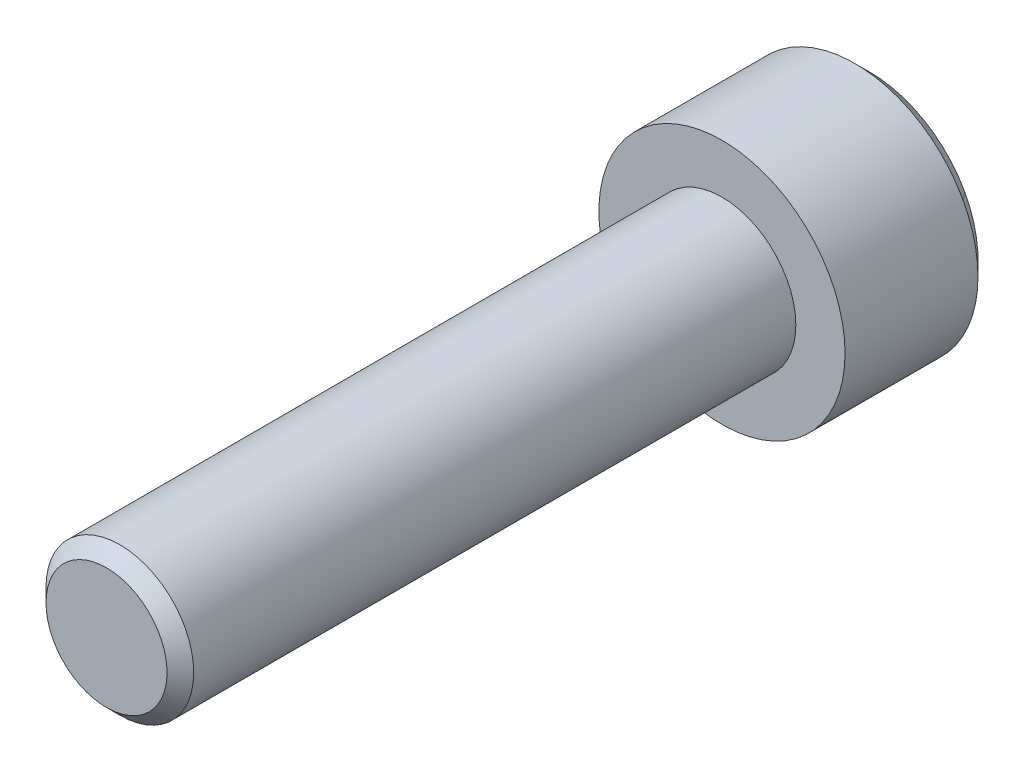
ISO-10303-21;
HEADER;
FILE_DESCRIPTION(('STEP AP214'),'2;1');
FILE_NAME('part.step','',(''),(''),'','','');
FILE_SCHEMA(('AUTOMOTIVE_DESIGN { 1 0 10303 214 1 1 1 1 }'));
ENDSEC;
DATA;
#1=APPLICATION_CONTEXT('core data for automotive mechanical design processes');
#2=APPLICATION_PROTOCOL_DEFINITION('international standard','automotive_design',2000,#1);
#3=PRODUCT_CONTEXT('',#1,'mechanical');
#4=PRODUCT('Part','Part','',(#3));
#5=PRODUCT_RELATED_PRODUCT_CATEGORY('part','',(#4));
#6=PRODUCT_DEFINITION_FORMATION('','',#4);
#7=PRODUCT_DEFINITION_CONTEXT('part definition',#1,'design');
#8=PRODUCT_DEFINITION('design','',#6,#7);
#9=PRODUCT_DEFINITION_SHAPE('','',#8);
#10=(LENGTH_UNIT() NAMED_UNIT(*) SI_UNIT(.MILLI.,.METRE.));
#11=(NAMED_UNIT(*) PLANE_ANGLE_UNIT() SI_UNIT($,.RADIAN.));
#12=(NAMED_UNIT(*) SI_UNIT($,.STERADIAN.) SOLID_ANGLE_UNIT());
#13=UNCERTAINTY_MEASURE_WITH_UNIT(LENGTH_MEASURE(1.E-05),#10,'distance_accuracy_value','');
#14=(GEOMETRIC_REPRESENTATION_CONTEXT(3) GLOBAL_UNCERTAINTY_ASSIGNED_CONTEXT((#13)) GLOBAL_UNIT_ASSIGNED_CONTEXT((#10,
#11,#12)) REPRESENTATION_CONTEXT('',''));
#15=CARTESIAN_POINT('',(0.,0.,0.));
#16=DIRECTION('',(0.,0.,1.));
#17=DIRECTION('',(1.,0.,0.));
#18=AXIS2_PLACEMENT_3D('',#15,#16,#17);
#19=CARTESIAN_POINT('',(0.,0.,2.99999999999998));
#20=DIRECTION('',(0.,0.,-1.));
#21=DIRECTION('',(-1.,0.,0.));
#22=AXIS2_PLACEMENT_3D('',#19,#20,#21);
#23=PLANE('',#22);
#24=DIRECTION('',(0.500000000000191,-0.86602540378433,0.));
#25=VECTOR('',#24,1.);
#26=CARTESIAN_POINT('',(1.44337567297,2.5,2.99999999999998));
#27=LINE('',#26,#25);
#28=CARTESIAN_POINT('',(2.88675134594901,-5.62050406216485E-13,2.99999999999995));
#29=VERTEX_POINT('',#28);
#30=CARTESIAN_POINT('',(1.44337567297,2.5,2.99999999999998));
#31=VERTEX_POINT('',#30);
#32=EDGE_CURVE('E88',#29,#31,#27,.F.);
#33=ORIENTED_EDGE('',*,*,#32,.F.);
#34=DIRECTION('',(-0.500000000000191,-0.86602540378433,0.));
#35=VECTOR('',#34,1.);
#36=CARTESIAN_POINT('',(2.88675134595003,0.,2.99999999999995));
#37=LINE('',#36,#35);
#38=CARTESIAN_POINT('',(1.44337567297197,-2.50000000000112,2.99999999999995));
#39=VERTEX_POINT('',#38);
#40=EDGE_CURVE('E96',#39,#29,#37,.F.);
#41=ORIENTED_EDGE('',*,*,#40,.F.);
#42=DIRECTION('',(-1.,0.,0.));
#43=VECTOR('',#42,1.);
#44=CARTESIAN_POINT('',(1.44337567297,-2.49999999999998,2.99999999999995));
#45=LINE('',#44,#43);
#46=CARTESIAN_POINT('',(-1.44337567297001,-2.5,2.99999999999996));
#47=VERTEX_POINT('',#46);
#48=EDGE_CURVE('E95',#47,#39,#45,.F.);
#49=ORIENTED_EDGE('',*,*,#48,.F.);
#50=DIRECTION('',(-0.500000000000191,0.86602540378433,0.));
#51=VECTOR('',#50,1.);
#52=CARTESIAN_POINT('',(-1.44337567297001,-2.5,2.99999999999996));
#53=LINE('',#52,#51);
#54=CARTESIAN_POINT('',(-2.88675134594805,1.13103970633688E-12,3.00000000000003));
#55=VERTEX_POINT('',#54);
#56=EDGE_CURVE('E247',#55,#47,#53,.F.);
#57=ORIENTED_EDGE('',*,*,#56,.F.);
#58=DIRECTION('',(0.500000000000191,0.86602540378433,0.));
#59=VECTOR('',#58,1.);
#60=CARTESIAN_POINT('',(-2.88675134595,0.,3.00000000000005));
#61=LINE('',#60,#59);
#62=CARTESIAN_POINT('',(-1.44337567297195,2.50000000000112,3.00000000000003));
#63=VERTEX_POINT('',#62);
#64=EDGE_CURVE('E243',#63,#55,#61,.F.);
#65=ORIENTED_EDGE('',*,*,#64,.F.);
#66=DIRECTION('',(1.,0.,0.));
#67=VECTOR('',#66,1.);
#68=CARTESIAN_POINT('',(-1.44337567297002,2.50000000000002,3.00000000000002));
#69=LINE('',#68,#67);
#70=EDGE_CURVE('E228',#31,#63,#69,.F.);
#71=ORIENTED_EDGE('',*,*,#70,.F.);
#72=EDGE_LOOP('',(#33,#41,#49,#57,#65,#71));
#73=FACE_BOUND('',#72,.T.);
#74=ADVANCED_FACE('F16',(#73),#23,.T.);
#75=CARTESIAN_POINT('',(2.88675134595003,0.,0.));
#76=DIRECTION('',(-0.86602540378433,0.500000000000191,0.));
#77=DIRECTION('',(-0.500000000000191,-0.86602540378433,0.));
#78=AXIS2_PLACEMENT_3D('',#75,#76,#77);
#79=PLANE('',#78);
#80=DIRECTION('',(0.,0.,1.));
#81=VECTOR('',#80,1.);
#82=CARTESIAN_POINT('',(1.44337567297,-2.49999999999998,0.));
#83=LINE('',#82,#81);
#84=CARTESIAN_POINT('',(1.44337567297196,-2.50000000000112,0.));
#85=VERTEX_POINT('',#84);
#86=EDGE_CURVE('E79',#39,#85,#83,.F.);
#87=ORIENTED_EDGE('',*,*,#86,.F.);
#88=ORIENTED_EDGE('',*,*,#40,.T.);
#89=DIRECTION('',(0.,0.,1.));
#90=VECTOR('',#89,1.);
#91=CARTESIAN_POINT('',(2.8867513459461,-2.22738494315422E-12,0.));
#92=LINE('',#91,#90);
#93=CARTESIAN_POINT('',(2.88675134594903,-5.51642065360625E-13,0.));
#94=VERTEX_POINT('',#93);
#95=EDGE_CURVE('E82',#94,#29,#92,.T.);
#96=ORIENTED_EDGE('',*,*,#95,.F.);
#97=DIRECTION('',(-0.500000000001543,-0.866025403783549,0.));
#98=VECTOR('',#97,1.);
#99=CARTESIAN_POINT('',(2.88675134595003,0.,0.));
#100=LINE('',#99,#98);
#101=EDGE_CURVE('E74',#94,#85,#100,.T.);
#102=ORIENTED_EDGE('',*,*,#101,.T.);
#103=EDGE_LOOP('',(#87,#88,#96,#102));
#104=FACE_BOUND('',#103,.T.);
#105=ADVANCED_FACE('F76',(#104),#79,.T.);
#106=CARTESIAN_POINT('',(1.44337567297,-2.49999999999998,0.));
#107=DIRECTION('',(0.,1.,0.));
#108=DIRECTION('',(-1.,0.,0.));
#109=AXIS2_PLACEMENT_3D('',#106,#107,#108);
#110=PLANE('',#109);
#111=DIRECTION('',(0.,0.,1.));
#112=VECTOR('',#111,1.);
#113=CARTESIAN_POINT('',(-1.44337567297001,-2.50000000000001,0.));
#114=LINE('',#113,#112);
#115=CARTESIAN_POINT('',(-1.44337567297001,-2.50000000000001,0.));
#116=VERTEX_POINT('',#115);
#117=EDGE_CURVE('E249',#47,#116,#114,.F.);
#118=ORIENTED_EDGE('',*,*,#117,.F.);
#119=ORIENTED_EDGE('',*,*,#48,.T.);
#120=ORIENTED_EDGE('',*,*,#86,.T.);
#121=DIRECTION('',(1.,0.,0.));
#122=VECTOR('',#121,1.);
#123=CARTESIAN_POINT('',(0.,-2.5,0.));
#124=LINE('',#123,#122);
#125=EDGE_CURVE('E87',#85,#116,#124,.F.);
#126=ORIENTED_EDGE('',*,*,#125,.T.);
#127=EDGE_LOOP('',(#118,#119,#120,#126));
#128=FACE_BOUND('',#127,.T.);
#129=ADVANCED_FACE('F92',(#128),#110,.T.);
#130=CARTESIAN_POINT('',(-1.44337567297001,-2.50000000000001,0.));
#131=DIRECTION('',(0.86602540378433,0.50000000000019,0.));
#132=DIRECTION('',(-0.500000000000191,0.86602540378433,0.));
#133=AXIS2_PLACEMENT_3D('',#130,#131,#132);
#134=PLANE('',#133);
#135=DIRECTION('',(0.,0.,1.));
#136=VECTOR('',#135,1.);
#137=CARTESIAN_POINT('',(-2.88675134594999,0.,0.));
#138=LINE('',#137,#136);
#139=CARTESIAN_POINT('',(-2.88675134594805,1.13450915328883E-12,0.));
#140=VERTEX_POINT('',#139);
#141=EDGE_CURVE('E242',#55,#140,#138,.F.);
#142=ORIENTED_EDGE('',*,*,#141,.F.);
#143=ORIENTED_EDGE('',*,*,#56,.T.);
#144=ORIENTED_EDGE('',*,*,#117,.T.);
#145=DIRECTION('',(-0.500000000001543,0.866025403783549,0.));
#146=VECTOR('',#145,1.);
#147=CARTESIAN_POINT('',(-1.44337567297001,-2.50000000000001,0.));
#148=LINE('',#147,#146);
#149=EDGE_CURVE('E101',#116,#140,#148,.T.);
#150=ORIENTED_EDGE('',*,*,#149,.T.);
#151=EDGE_LOOP('',(#142,#143,#144,#150));
#152=FACE_BOUND('',#151,.T.);
#153=ADVANCED_FACE('F209',(#152),#134,.T.);
#154=CARTESIAN_POINT('',(-2.88675134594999,0.,0.));
#155=DIRECTION('',(0.86602540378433,-0.500000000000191,0.));
#156=DIRECTION('',(0.500000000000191,0.86602540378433,0.));
#157=AXIS2_PLACEMENT_3D('',#154,#155,#156);
#158=PLANE('',#157);
#159=DIRECTION('',(0.,0.,-1.));
#160=VECTOR('',#159,1.);
#161=CARTESIAN_POINT('',(-1.44337567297,2.50000000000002,0.));
#162=LINE('',#161,#160);
#163=CARTESIAN_POINT('',(-1.44337567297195,2.50000000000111,0.));
#164=VERTEX_POINT('',#163);
#165=EDGE_CURVE('E240',#63,#164,#162,.T.);
#166=ORIENTED_EDGE('',*,*,#165,.F.);
#167=ORIENTED_EDGE('',*,*,#64,.T.);
#168=ORIENTED_EDGE('',*,*,#141,.T.);
#169=DIRECTION('',(0.500000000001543,0.866025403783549,0.));
#170=VECTOR('',#169,1.);
#171=CARTESIAN_POINT('',(-2.88675134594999,0.,0.));
#172=LINE('',#171,#170);
#173=EDGE_CURVE('E103',#140,#164,#172,.T.);
#174=ORIENTED_EDGE('',*,*,#173,.T.);
#175=EDGE_LOOP('',(#166,#167,#168,#174));
#176=FACE_BOUND('',#175,.T.);
#177=ADVANCED_FACE('F206',(#176),#158,.T.);
#178=CARTESIAN_POINT('',(-1.44337567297,2.50000000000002,0.));
#179=DIRECTION('',(0.,-1.,0.));
#180=DIRECTION('',(0.,0.,-1.));
#181=AXIS2_PLACEMENT_3D('',#178,#179,#180);
#182=PLANE('',#181);
#183=DIRECTION('',(0.,0.,1.));
#184=VECTOR('',#183,1.);
#185=CARTESIAN_POINT('',(1.44337567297,2.50000000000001,0.));
#186=LINE('',#185,#184);
#187=CARTESIAN_POINT('',(1.44337567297,2.50000000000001,0.));
#188=VERTEX_POINT('',#187);
#189=EDGE_CURVE('E230',#31,#188,#186,.F.);
#190=ORIENTED_EDGE('',*,*,#189,.F.);
#191=ORIENTED_EDGE('',*,*,#70,.T.);
#192=ORIENTED_EDGE('',*,*,#165,.T.);
#193=DIRECTION('',(1.,0.,0.));
#194=VECTOR('',#193,1.);
#195=CARTESIAN_POINT('',(0.,2.50000000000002,0.));
#196=LINE('',#195,#194);
#197=EDGE_CURVE('E52',#164,#188,#196,.T.);
#198=ORIENTED_EDGE('',*,*,#197,.T.);
#199=EDGE_LOOP('',(#190,#191,#192,#198));
#200=FACE_BOUND('',#199,.T.);
#201=ADVANCED_FACE('F200',(#200),#182,.T.);
#202=CARTESIAN_POINT('',(1.44337567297,2.50000000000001,0.));
#203=DIRECTION('',(-0.86602540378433,-0.50000000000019,0.));
#204=DIRECTION('',(0.500000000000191,-0.86602540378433,0.));
#205=AXIS2_PLACEMENT_3D('',#202,#203,#204);
#206=PLANE('',#205);
#207=ORIENTED_EDGE('',*,*,#95,.T.);
#208=ORIENTED_EDGE('',*,*,#32,.T.);
#209=ORIENTED_EDGE('',*,*,#189,.T.);
#210=DIRECTION('',(0.500000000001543,-0.866025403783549,0.));
#211=VECTOR('',#210,1.);
#212=CARTESIAN_POINT('',(1.44337567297,2.50000000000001,0.));
#213=LINE('',#212,#211);
#214=EDGE_CURVE('E144',#188,#94,#213,.T.);
#215=ORIENTED_EDGE('',*,*,#214,.T.);
#216=EDGE_LOOP('',(#207,#208,#209,#215));
#217=FACE_BOUND('',#216,.T.);
#218=ADVANCED_FACE('F160',(#217),#206,.T.);
#219=CARTESIAN_POINT('',(0.,0.,0.));
#220=DIRECTION('',(0.,0.,1.));
#221=DIRECTION('',(1.,0.,0.));
#222=AXIS2_PLACEMENT_3D('',#219,#220,#221);
#223=PLANE('',#222);
#224=ORIENTED_EDGE('',*,*,#197,.F.);
#225=ORIENTED_EDGE('',*,*,#173,.F.);
#226=ORIENTED_EDGE('',*,*,#149,.F.);
#227=ORIENTED_EDGE('',*,*,#125,.F.);
#228=ORIENTED_EDGE('',*,*,#101,.F.);
#229=ORIENTED_EDGE('',*,*,#214,.F.);
#230=EDGE_LOOP('',(#224,#225,#226,#227,#228,#229));
#231=FACE_BOUND('',#230,.T.);
#232=CARTESIAN_POINT('',(0.,0.,4.98975860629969E-11));
#233=DIRECTION('',(0.,0.,1.));
#234=DIRECTION('',(0.,-1.,0.));
#235=AXIS2_PLACEMENT_3D('',#232,#233,#234);
#236=CIRCLE('',#235,4.40000000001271);
#237=CARTESIAN_POINT('',(3.86136327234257,2.10947236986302,2.47094011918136E-11));
#238=VERTEX_POINT('',#237);
#239=CARTESIAN_POINT('',(-3.8613632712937,-2.10947237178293,2.81788481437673E-11));
#240=VERTEX_POINT('',#239);
#241=EDGE_CURVE('E137',#238,#240,#236,.T.);
#242=ORIENTED_EDGE('',*,*,#241,.F.);
#243=CARTESIAN_POINT('',(0.,0.,-3.46944695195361E-13));
#244=DIRECTION('',(0.,0.,0.999999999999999));
#245=DIRECTION('',(1.,0.,0.));
#246=AXIS2_PLACEMENT_3D('',#243,#244,#245);
#247=CIRCLE('',#246,4.40000000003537);
#248=EDGE_CURVE('E20',#240,#238,#247,.T.);
#249=ORIENTED_EDGE('',*,*,#248,.F.);
#250=EDGE_LOOP('',(#242,#249));
#251=FACE_BOUND('',#250,.T.);
#252=ADVANCED_FACE('F99',(#231,#251),#223,.F.);
#253=CARTESIAN_POINT('',(0.,0.,0.600000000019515));
#254=DIRECTION('',(0.,0.,0.999999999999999));
#255=DIRECTION('',(1.,0.,0.));
#256=AXIS2_PLACEMENT_3D('',#253,#254,#255);
#257=CONICAL_SURFACE('',#256,5.00000000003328,0.785398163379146);
#258=DIRECTION('',(-0.620544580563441,-0.339005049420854,-0.707106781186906));
#259=VECTOR('',#258,1.);
#260=CARTESIAN_POINT('',(437917.559746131,239235.453235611,499000.));
#261=LINE('',#260,#259);
#262=CARTESIAN_POINT('',(4.38791280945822,2.39712769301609,0.600000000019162));
#263=VERTEX_POINT('',#262);
#264=EDGE_CURVE('E35',#263,#238,#261,.T.);
#265=ORIENTED_EDGE('',*,*,#264,.F.);
#266=CARTESIAN_POINT('',(0.,0.,0.599999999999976));
#267=DIRECTION('',(0.,0.,1.));
#268=DIRECTION('',(1.,0.,0.));
#269=AXIS2_PLACEMENT_3D('',#266,#267,#268);
#270=CIRCLE('',#269,5.);
#271=CARTESIAN_POINT('',(-4.38791280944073,-2.39712769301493,0.59999999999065));
#272=VERTEX_POINT('',#271);
#273=EDGE_CURVE('E141',#272,#263,#270,.T.);
#274=ORIENTED_EDGE('',*,*,#273,.F.);
#275=CARTESIAN_POINT('',(-3.86136327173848,-2.10947237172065,-5.3256010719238E-13));
#276=CARTESIAN_POINT('',(-3.88330283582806,-2.12145801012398,0.0250000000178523));
#277=CARTESIAN_POINT('',(-3.90524239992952,-2.13344364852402,0.0500000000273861));
#278=CARTESIAN_POINT('',(-3.94912152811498,-2.15741492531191,0.100000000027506));
#279=CARTESIAN_POINT('',(-3.97106109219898,-2.16940056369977,0.125000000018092));
#280=CARTESIAN_POINT('',(-4.01494022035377,-2.19337184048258,0.175000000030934));
#281=CARTESIAN_POINT('',(-4.03687978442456,-2.20535747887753,0.20000000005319));
#282=CARTESIAN_POINT('',(-4.08075891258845,-2.22932875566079,0.250000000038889));
#283=CARTESIAN_POINT('',(-4.10269847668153,-2.24131439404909,0.275000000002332));
#284=CARTESIAN_POINT('',(-4.14657760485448,-2.26528567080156,0.324999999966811));
#285=CARTESIAN_POINT('',(-4.16851716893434,-2.27727130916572,0.349999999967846));
#286=CARTESIAN_POINT('',(-4.21239629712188,-2.30124258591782,0.399999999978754));
#287=CARTESIAN_POINT('',(-4.23433586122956,-2.31322822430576,0.424999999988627));
#288=CARTESIAN_POINT('',(-4.27821498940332,-2.33719950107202,0.474999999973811));
#289=CARTESIAN_POINT('',(-4.30015455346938,-2.34918513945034,0.499999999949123));
#290=CARTESIAN_POINT('',(-4.34403368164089,-2.37315641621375,0.549999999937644));
#291=CARTESIAN_POINT('',(-4.36597324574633,-2.38514205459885,0.574999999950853));
#292=CARTESIAN_POINT('',(-4.38791280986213,-2.3971276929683,0.599999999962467));
#293=B_SPLINE_CURVE_WITH_KNOTS('',3,(#275,#276,#277,#278,#279,#280,#281,#282,#283,#284,#285,
#286,#287,#288,#289,#290,#291,#292),.UNSPECIFIED.,.F.,.F.,(4,2,2,2,2,2,2,2,4),(0.,
0.10606601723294,0.212132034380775,0.31819805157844,0.424264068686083,0.530330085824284,
0.636396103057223,0.742462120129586,0.848528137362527),.UNSPECIFIED.);
#294=EDGE_CURVE('E122',#240,#272,#293,.T.);
#295=ORIENTED_EDGE('',*,*,#294,.F.);
#296=ORIENTED_EDGE('',*,*,#248,.T.);
#297=EDGE_LOOP('',(#265,#274,#295,#296));
#298=FACE_BOUND('',#297,.T.);
#299=ADVANCED_FACE('F113',(#298),#257,.T.);
#300=CARTESIAN_POINT('',(0.,0.,0.599999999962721));
#301=DIRECTION('',(0.,0.,1.));
#302=DIRECTION('',(0.,-1.,0.));
#303=AXIS2_PLACEMENT_3D('',#300,#301,#302);
#304=CONICAL_SURFACE('',#303,4.99999999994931,0.785398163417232);
#305=ORIENTED_EDGE('',*,*,#294,.T.);
#306=CARTESIAN_POINT('',(0.,0.,0.599999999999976));
#307=DIRECTION('',(0.,0.,1.));
#308=DIRECTION('',(1.,0.,0.));
#309=AXIS2_PLACEMENT_3D('',#306,#307,#308);
#310=CIRCLE('',#309,5.);
#311=EDGE_CURVE('E136',#263,#272,#310,.T.);
#312=ORIENTED_EDGE('',*,*,#311,.F.);
#313=ORIENTED_EDGE('',*,*,#264,.T.);
#314=ORIENTED_EDGE('',*,*,#241,.T.);
#315=EDGE_LOOP('',(#305,#312,#313,#314));
#316=FACE_BOUND('',#315,.T.);
#317=ADVANCED_FACE('F115',(#316),#304,.T.);
#318=CARTESIAN_POINT('',(0.,0.,15.5));
#319=DIRECTION('',(0.,0.,1.));
#320=DIRECTION('',(1.,0.,0.));
#321=AXIS2_PLACEMENT_3D('',#318,#319,#320);
#322=CYLINDRICAL_SURFACE('',#321,5.);
#323=CARTESIAN_POINT('',(0.,0.,5.99999999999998));
#324=DIRECTION('',(0.,0.,1.));
#325=DIRECTION('',(1.,0.,0.));
#326=AXIS2_PLACEMENT_3D('',#323,#324,#325);
#327=CIRCLE('',#326,5.);
#328=CARTESIAN_POINT('',(4.99999999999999,0.,5.99999999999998));
#329=VERTEX_POINT('',#328);
#330=EDGE_CURVE('E134',#329,#329,#327,.T.);
#331=ORIENTED_EDGE('',*,*,#330,.F.);
#332=EDGE_LOOP('',(#331));
#333=FACE_BOUND('',#332,.T.);
#334=ORIENTED_EDGE('',*,*,#311,.T.);
#335=ORIENTED_EDGE('',*,*,#273,.T.);
#336=EDGE_LOOP('',(#334,#335));
#337=FACE_BOUND('',#336,.T.);
#338=ADVANCED_FACE('F153',(#333,#337),#322,.T.);
#339=CARTESIAN_POINT('',(2.45850000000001,0.,30.9999999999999));
#340=DIRECTION('',(0.,0.,1.));
#341=DIRECTION('',(1.,0.,0.));
#342=AXIS2_PLACEMENT_3D('',#339,#340,#341);
#343=PLANE('',#342);
#344=CARTESIAN_POINT('',(0.,0.,30.9999999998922));
#345=DIRECTION('',(0.,0.,-1.));
#346=DIRECTION('',(-1.,0.,0.));
#347=AXIS2_PLACEMENT_3D('',#344,#345,#346);
#348=CIRCLE('',#347,2.45850000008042);
#349=CARTESIAN_POINT('',(-2.4585000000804,0.,30.9999999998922));
#350=VERTEX_POINT('',#349);
#351=EDGE_CURVE('E131',#350,#350,#348,.T.);
#352=ORIENTED_EDGE('',*,*,#351,.F.);
#353=EDGE_LOOP('',(#352));
#354=FACE_BOUND('',#353,.T.);
#355=ADVANCED_FACE('F176',(#354),#343,.T.);
#356=CARTESIAN_POINT('',(5.00000000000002,0.,5.99999999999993));
#357=DIRECTION('',(0.,0.,1.));
#358=DIRECTION('',(1.,0.,0.));
#359=AXIS2_PLACEMENT_3D('',#356,#357,#358);
#360=PLANE('',#359);
#361=CARTESIAN_POINT('',(0.,0.,5.99999999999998));
#362=DIRECTION('',(0.,0.,1.));
#363=DIRECTION('',(1.,0.,0.));
#364=AXIS2_PLACEMENT_3D('',#361,#362,#363);
#365=CIRCLE('',#364,3.);
#366=CARTESIAN_POINT('',(2.99999999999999,0.,5.99999999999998));
#367=VERTEX_POINT('',#366);
#368=EDGE_CURVE('E26',#367,#367,#365,.T.);
#369=ORIENTED_EDGE('',*,*,#368,.F.);
#370=EDGE_LOOP('',(#369));
#371=FACE_BOUND('',#370,.T.);
#372=ORIENTED_EDGE('',*,*,#330,.T.);
#373=EDGE_LOOP('',(#372));
#374=FACE_BOUND('',#373,.T.);
#375=ADVANCED_FACE('F167',(#371,#374),#360,.T.);
#376=CARTESIAN_POINT('',(0.,0.,30.4584999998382));
#377=DIRECTION('',(0.,0.,-1.));
#378=DIRECTION('',(-1.,0.,0.));
#379=AXIS2_PLACEMENT_3D('',#376,#377,#378);
#380=CONICAL_SURFACE('',#379,3.0000000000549,0.785398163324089);
#381=CARTESIAN_POINT('',(0.,0.,30.4585));
#382=DIRECTION('',(0.,0.,1.));
#383=DIRECTION('',(1.,0.,0.));
#384=AXIS2_PLACEMENT_3D('',#381,#382,#383);
#385=CIRCLE('',#384,3.);
#386=CARTESIAN_POINT('',(-2.99999999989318,0.,30.4585));
#387=VERTEX_POINT('',#386);
#388=EDGE_CURVE('E11',#387,#387,#385,.F.);
#389=CARTESIAN_POINT('',(-2.4585000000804,0.,30.9999999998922));
#390=CARTESIAN_POINT('',(-2.46414062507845,0.,30.9943593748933));
#391=CARTESIAN_POINT('',(-2.4697812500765,0.,30.9887187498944));
#392=CARTESIAN_POINT('',(-2.4810625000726,0.,30.9774374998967));
#393=CARTESIAN_POINT('',(-2.48670312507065,0.,30.9717968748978));
#394=CARTESIAN_POINT('',(-2.49798437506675,0.,30.9605156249));
#395=CARTESIAN_POINT('',(-2.5036250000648,0.,30.9548749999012));
#396=CARTESIAN_POINT('',(-2.5149062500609,0.,30.9435937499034));
#397=CARTESIAN_POINT('',(-2.52054687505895,0.,30.9379531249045));
#398=CARTESIAN_POINT('',(-2.53182812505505,0.,30.9266718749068));
#399=CARTESIAN_POINT('',(-2.5374687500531,0.,30.9210312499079));
#400=CARTESIAN_POINT('',(-2.5487500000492,0.,30.9097499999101));
#401=CARTESIAN_POINT('',(-2.55439062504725,0.,30.9041093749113));
#402=CARTESIAN_POINT('',(-2.56567187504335,0.,30.8928281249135));
#403=CARTESIAN_POINT('',(-2.5713125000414,0.,30.8871874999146));
#404=CARTESIAN_POINT('',(-2.5825937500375,0.,30.8759062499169));
#405=CARTESIAN_POINT('',(-2.58823437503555,0.,30.870265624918));
#406=CARTESIAN_POINT('',(-2.59951562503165,0.,30.8589843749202));
#407=CARTESIAN_POINT('',(-2.6051562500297,0.,30.8533437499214));
#408=CARTESIAN_POINT('',(-2.6164375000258,0.,30.8420624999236));
#409=CARTESIAN_POINT('',(-2.62207812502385,0.,30.8364218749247));
#410=CARTESIAN_POINT('',(-2.63335937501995,0.,30.825140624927));
#411=CARTESIAN_POINT('',(-2.639000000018,0.,30.8194999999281));
#412=CARTESIAN_POINT('',(-2.6502812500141,0.,30.8082187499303));
#413=CARTESIAN_POINT('',(-2.65592187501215,0.,30.8025781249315));
#414=CARTESIAN_POINT('',(-2.66720312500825,0.,30.7912968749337));
#415=CARTESIAN_POINT('',(-2.6728437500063,0.,30.7856562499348));
#416=CARTESIAN_POINT('',(-2.6841250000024,0.,30.7743749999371));
#417=CARTESIAN_POINT('',(-2.68976562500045,0.,30.7687343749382));
#418=CARTESIAN_POINT('',(-2.70104687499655,0.,30.7574531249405));
#419=CARTESIAN_POINT('',(-2.7066874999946,0.,30.7518124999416));
#420=CARTESIAN_POINT('',(-2.71796874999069,0.,30.7405312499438));
#421=CARTESIAN_POINT('',(-2.72360937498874,0.,30.7348906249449));
#422=CARTESIAN_POINT('',(-2.73489062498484,0.,30.7236093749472));
#423=CARTESIAN_POINT('',(-2.74053124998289,0.,30.7179687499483));
#424=CARTESIAN_POINT('',(-2.75181249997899,0.,30.7066874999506));
#425=CARTESIAN_POINT('',(-2.75745312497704,0.,30.7010468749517));
#426=CARTESIAN_POINT('',(-2.76873437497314,0.,30.6897656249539));
#427=CARTESIAN_POINT('',(-2.77437499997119,0.,30.684124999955));
#428=CARTESIAN_POINT('',(-2.78565624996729,0.,30.6728437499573));
#429=CARTESIAN_POINT('',(-2.79129687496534,0.,30.6672031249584));
#430=CARTESIAN_POINT('',(-2.80257812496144,0.,30.6559218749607));
#431=CARTESIAN_POINT('',(-2.80821874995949,0.,30.6502812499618));
#432=CARTESIAN_POINT('',(-2.81949999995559,0.,30.638999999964));
#433=CARTESIAN_POINT('',(-2.82514062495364,0.,30.6333593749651));
#434=CARTESIAN_POINT('',(-2.83642187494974,0.,30.6220781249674));
#435=CARTESIAN_POINT('',(-2.84206249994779,0.,30.6164374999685));
#436=CARTESIAN_POINT('',(-2.85334374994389,0.,30.6051562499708));
#437=CARTESIAN_POINT('',(-2.85898437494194,0.,30.5995156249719));
#438=CARTESIAN_POINT('',(-2.87026562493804,0.,30.5882343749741));
#439=CARTESIAN_POINT('',(-2.87590624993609,0.,30.5825937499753));
#440=CARTESIAN_POINT('',(-2.88718749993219,0.,30.5713124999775));
#441=CARTESIAN_POINT('',(-2.89282812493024,0.,30.5656718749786));
#442=CARTESIAN_POINT('',(-2.90410937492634,0.,30.5543906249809));
#443=CARTESIAN_POINT('',(-2.90974999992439,0.,30.548749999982));
#444=CARTESIAN_POINT('',(-2.92103124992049,0.,30.5374687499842));
#445=CARTESIAN_POINT('',(-2.92667187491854,0.,30.5318281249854));
#446=CARTESIAN_POINT('',(-2.93795312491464,0.,30.5205468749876));
#447=CARTESIAN_POINT('',(-2.94359374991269,0.,30.5149062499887));
#448=CARTESIAN_POINT('',(-2.95487499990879,0.,30.503624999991));
#449=CARTESIAN_POINT('',(-2.96051562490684,0.,30.4979843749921));
#450=CARTESIAN_POINT('',(-2.97179687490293,0.,30.4867031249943));
#451=CARTESIAN_POINT('',(-2.97743749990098,0.,30.4810624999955));
#452=CARTESIAN_POINT('',(-2.98871874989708,0.,30.4697812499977));
#453=CARTESIAN_POINT('',(-2.99435937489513,0.,30.4641406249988));
#454=CARTESIAN_POINT('',(-2.99999999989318,0.,30.4585));
#455=B_SPLINE_CURVE_WITH_KNOTS('',3,(#389,#390,#391,#392,#393,#394,#395,#396,#397,#398,#399,
#400,#401,#402,#403,#404,#405,#406,#407,#408,#409,#410,#411,#412,#413,#414,#415,#416,#417,#418,
#419,#420,#421,#422,#423,#424,#425,#426,#427,#428,#429,#430,#431,#432,#433,#434,#435,#436,#437,
#438,#439,#440,#441,#442,#443,#444,#445,#446,#447,#448,#449,#450,#451,#452,#453,#454),
.UNSPECIFIED.,.F.,.F.,(4,2,2,2,2,2,2,2,2,2,2,2,2,2,2,2,2,2,2,2,2,2,2,2,2,2,2,2,2,2,2,2,4),(0.,
0.0239311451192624,0.0478622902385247,0.0717934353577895,0.0957245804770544,0.119655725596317,
0.143586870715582,0.167518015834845,0.191449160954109,0.215380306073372,0.239311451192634,
0.263242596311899,0.287173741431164,0.311104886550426,0.335036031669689,0.358967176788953,
0.382898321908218,0.406829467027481,0.430760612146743,0.454691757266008,0.47862290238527,
0.502554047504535,0.5264851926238,0.550416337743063,0.574347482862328,0.59827862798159,
0.622209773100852,0.646140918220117,0.670072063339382,0.694003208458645,0.71793435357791,
0.741865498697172,0.765796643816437),.UNSPECIFIED.);
#456=EDGE_CURVE('BSEAM162',#350,#387,#455,.T.);
#457=ORIENTED_EDGE('',*,*,#351,.T.);
#458=ORIENTED_EDGE('',*,*,#388,.F.);
#459=ORIENTED_EDGE('',*,*,#456,.T.);
#460=ORIENTED_EDGE('',*,*,#456,.F.);
#461=EDGE_LOOP('',(#457,#459,#458,#460));
#462=FACE_BOUND('',#461,.T.);
#463=ADVANCED_FACE('F162',(#462),#380,.T.);
#464=CARTESIAN_POINT('',(0.,0.,15.5));
#465=DIRECTION('',(0.,0.,1.));
#466=DIRECTION('',(1.,0.,0.));
#467=AXIS2_PLACEMENT_3D('',#464,#465,#466);
#468=CYLINDRICAL_SURFACE('',#467,3.);
#469=ORIENTED_EDGE('',*,*,#368,.T.);
#470=EDGE_LOOP('',(#469));
#471=FACE_BOUND('',#470,.T.);
#472=ORIENTED_EDGE('',*,*,#388,.T.);
#473=EDGE_LOOP('',(#472));
#474=FACE_BOUND('',#473,.T.);
#475=ADVANCED_FACE('F18',(#471,#474),#468,.T.);
#476=CLOSED_SHELL('',(#74,#105,#129,#153,#177,#201,#218,#252,#299,#317,#338,#355,#375,#463,#475));
#477=MANIFOLD_SOLID_BREP('B1',#476);
#478=ADVANCED_BREP_SHAPE_REPRESENTATION('',(#18,#477),#14);
#479=SHAPE_DEFINITION_REPRESENTATION(#9,#478);
ENDSEC;
END-ISO-10303-21;
